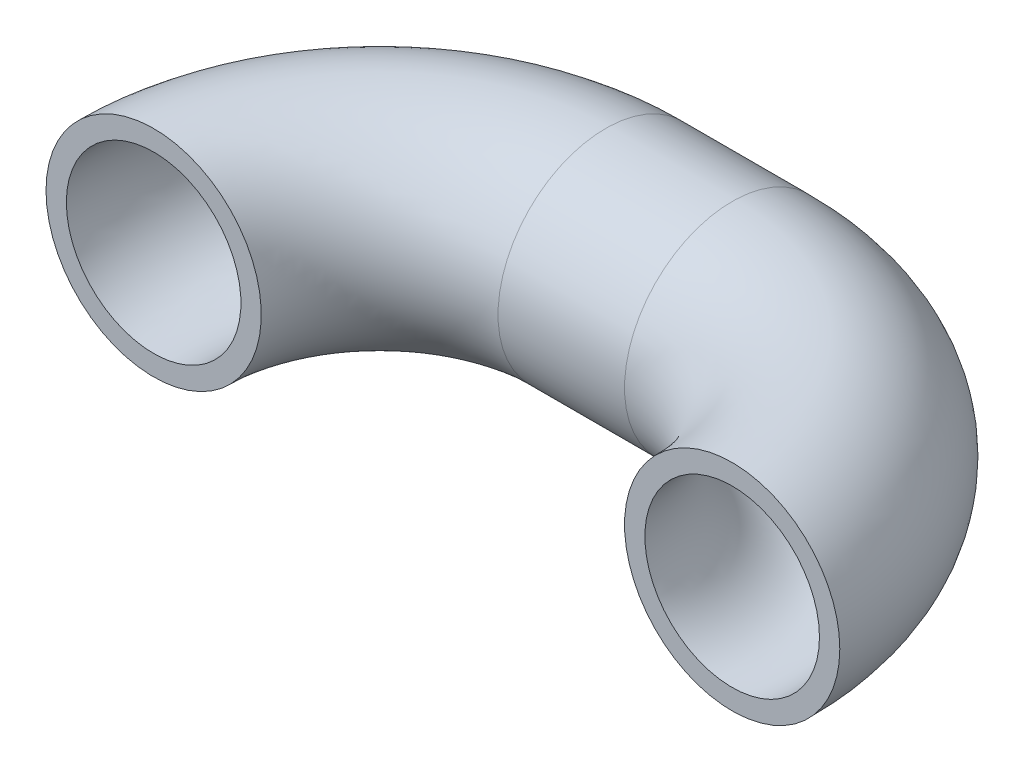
ISO-10303-21;
HEADER;
FILE_DESCRIPTION(('STEP AP214'),'2;1');
FILE_NAME('part.step','',(''),(''),'','','');
FILE_SCHEMA(('AUTOMOTIVE_DESIGN { 1 0 10303 214 1 1 1 1 }'));
ENDSEC;
DATA;
#1=APPLICATION_CONTEXT('core data for automotive mechanical design processes');
#2=APPLICATION_PROTOCOL_DEFINITION('international standard','automotive_design',2000,#1);
#3=PRODUCT_CONTEXT('',#1,'mechanical');
#4=PRODUCT('Part','Part','',(#3));
#5=PRODUCT_RELATED_PRODUCT_CATEGORY('part','',(#4));
#6=PRODUCT_DEFINITION_FORMATION('','',#4);
#7=PRODUCT_DEFINITION_CONTEXT('part definition',#1,'design');
#8=PRODUCT_DEFINITION('design','',#6,#7);
#9=PRODUCT_DEFINITION_SHAPE('','',#8);
#10=(LENGTH_UNIT() NAMED_UNIT(*) SI_UNIT(.MILLI.,.METRE.));
#11=(NAMED_UNIT(*) PLANE_ANGLE_UNIT() SI_UNIT($,.RADIAN.));
#12=(NAMED_UNIT(*) SI_UNIT($,.STERADIAN.) SOLID_ANGLE_UNIT());
#13=UNCERTAINTY_MEASURE_WITH_UNIT(LENGTH_MEASURE(1.E-05),#10,'distance_accuracy_value','');
#14=(GEOMETRIC_REPRESENTATION_CONTEXT(3) GLOBAL_UNCERTAINTY_ASSIGNED_CONTEXT((#13)) GLOBAL_UNIT_ASSIGNED_CONTEXT((#10,
#11,#12)) REPRESENTATION_CONTEXT('',''));
#15=CARTESIAN_POINT('',(0.,0.,0.));
#16=DIRECTION('',(0.,0.,1.));
#17=DIRECTION('',(1.,0.,0.));
#18=AXIS2_PLACEMENT_3D('',#15,#16,#17);
#19=CARTESIAN_POINT('',(-10.,0.,0.));
#20=DIRECTION('',(0.,-1.,0.));
#21=DIRECTION('',(0.,0.,-1.));
#22=AXIS2_PLACEMENT_3D('',#19,#20,#21);
#23=TOROIDAL_SURFACE('',#22,10.,3.8625);
#24=CARTESIAN_POINT('',(-10.,0.,-10.));
#25=DIRECTION('',(1.,0.,0.));
#26=DIRECTION('',(0.,0.,-1.));
#27=AXIS2_PLACEMENT_3D('',#24,#25,#26);
#28=CIRCLE('',#27,3.8625);
#29=CARTESIAN_POINT('',(-10.,0.,-13.8625));
#30=VERTEX_POINT('',#29);
#31=EDGE_CURVE('E10',#30,#30,#28,.T.);
#32=CARTESIAN_POINT('',(0.,0.,0.));
#33=DIRECTION('',(0.,0.,1.));
#34=DIRECTION('',(1.,0.,0.));
#35=AXIS2_PLACEMENT_3D('',#32,#33,#34);
#36=CIRCLE('',#35,3.8625);
#37=CARTESIAN_POINT('',(3.8625,0.,0.));
#38=VERTEX_POINT('',#37);
#39=EDGE_CURVE('E44',#38,#38,#36,.T.);
#40=CARTESIAN_POINT('',(-10.,0.,0.));
#41=DIRECTION('',(0.,-1.,0.));
#42=DIRECTION('',(0.,0.,-1.));
#43=AXIS2_PLACEMENT_3D('',#40,#41,#42);
#44=CIRCLE('',#43,13.8625);
#45=EDGE_CURVE('',#30,#38,#44,.T.);
#46=ORIENTED_EDGE('',*,*,#31,.F.);
#47=ORIENTED_EDGE('',*,*,#39,.T.);
#48=ORIENTED_EDGE('',*,*,#45,.T.);
#49=ORIENTED_EDGE('',*,*,#45,.F.);
#50=EDGE_LOOP('',(#46,#48,#47,#49));
#51=FACE_BOUND('',#50,.T.);
#52=ADVANCED_FACE('F33',(#51),#23,.F.);
#53=CARTESIAN_POINT('',(-10.,0.,0.));
#54=DIRECTION('',(0.,-1.,0.));
#55=DIRECTION('',(0.,0.,-1.));
#56=AXIS2_PLACEMENT_3D('',#53,#54,#55);
#57=TOROIDAL_SURFACE('',#56,10.,4.7625);
#58=CARTESIAN_POINT('',(-10.,0.,-10.));
#59=DIRECTION('',(-1.,0.,0.));
#60=DIRECTION('',(0.,0.,1.));
#61=AXIS2_PLACEMENT_3D('',#58,#59,#60);
#62=CIRCLE('',#61,4.7625);
#63=CARTESIAN_POINT('',(-10.0000000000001,0.,-14.7625));
#64=VERTEX_POINT('',#63);
#65=EDGE_CURVE('E51',#64,#64,#62,.T.);
#66=CARTESIAN_POINT('',(0.,0.,0.));
#67=DIRECTION('',(0.,0.,1.));
#68=DIRECTION('',(1.,0.,0.));
#69=AXIS2_PLACEMENT_3D('',#66,#67,#68);
#70=CIRCLE('',#69,4.7625);
#71=CARTESIAN_POINT('',(4.7625,0.,0.));
#72=VERTEX_POINT('',#71);
#73=EDGE_CURVE('E40',#72,#72,#70,.T.);
#74=CARTESIAN_POINT('',(-10.,0.,0.));
#75=DIRECTION('',(0.,-1.,0.));
#76=DIRECTION('',(0.,0.,-1.));
#77=AXIS2_PLACEMENT_3D('',#74,#75,#76);
#78=CIRCLE('',#77,14.7625);
#79=EDGE_CURVE('',#64,#72,#78,.T.);
#80=ORIENTED_EDGE('',*,*,#65,.F.);
#81=ORIENTED_EDGE('',*,*,#73,.F.);
#82=ORIENTED_EDGE('',*,*,#79,.T.);
#83=ORIENTED_EDGE('',*,*,#79,.F.);
#84=EDGE_LOOP('',(#80,#82,#81,#83));
#85=FACE_BOUND('',#84,.T.);
#86=ADVANCED_FACE('F35',(#85),#57,.T.);
#87=CARTESIAN_POINT('',(0.,0.,0.));
#88=DIRECTION('',(0.,0.,1.));
#89=DIRECTION('',(1.,0.,0.));
#90=AXIS2_PLACEMENT_3D('',#87,#88,#89);
#91=PLANE('',#90);
#92=ORIENTED_EDGE('',*,*,#39,.F.);
#93=EDGE_LOOP('',(#92));
#94=FACE_BOUND('',#93,.T.);
#95=ORIENTED_EDGE('',*,*,#73,.T.);
#96=EDGE_LOOP('',(#95));
#97=FACE_BOUND('',#96,.T.);
#98=ADVANCED_FACE('F90',(#94,#97),#91,.T.);
#99=CARTESIAN_POINT('',(-15.5976,0.,-9.99999999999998));
#100=DIRECTION('',(1.,0.,0.));
#101=DIRECTION('',(0.,0.,-1.));
#102=AXIS2_PLACEMENT_3D('',#99,#100,#101);
#103=CYLINDRICAL_SURFACE('',#102,4.7625);
#104=CARTESIAN_POINT('',(-15.5976,0.,-9.99999999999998));
#105=DIRECTION('',(-1.,0.,0.));
#106=DIRECTION('',(0.,0.,1.));
#107=AXIS2_PLACEMENT_3D('',#104,#105,#106);
#108=CIRCLE('',#107,4.7625);
#109=CARTESIAN_POINT('',(-15.5976,0.,-14.7625));
#110=VERTEX_POINT('',#109);
#111=EDGE_CURVE('E48',#110,#110,#108,.T.);
#112=ORIENTED_EDGE('',*,*,#111,.F.);
#113=EDGE_LOOP('',(#112));
#114=FACE_BOUND('',#113,.T.);
#115=ORIENTED_EDGE('',*,*,#65,.T.);
#116=EDGE_LOOP('',(#115));
#117=FACE_BOUND('',#116,.T.);
#118=ADVANCED_FACE('F96',(#114,#117),#103,.T.);
#119=CARTESIAN_POINT('',(-15.5976,0.,-9.99999999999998));
#120=DIRECTION('',(1.,0.,0.));
#121=DIRECTION('',(0.,0.,-1.));
#122=AXIS2_PLACEMENT_3D('',#119,#120,#121);
#123=CYLINDRICAL_SURFACE('',#122,3.8625);
#124=CARTESIAN_POINT('',(-15.5976,0.,-10.));
#125=DIRECTION('',(-1.,0.,0.));
#126=DIRECTION('',(0.,0.,1.));
#127=AXIS2_PLACEMENT_3D('',#124,#125,#126);
#128=CIRCLE('',#127,3.8625);
#129=CARTESIAN_POINT('',(-15.5976,0.,-13.8625));
#130=VERTEX_POINT('',#129);
#131=EDGE_CURVE('E54',#130,#130,#128,.T.);
#132=ORIENTED_EDGE('',*,*,#131,.T.);
#133=EDGE_LOOP('',(#132));
#134=FACE_BOUND('',#133,.T.);
#135=ORIENTED_EDGE('',*,*,#31,.T.);
#136=EDGE_LOOP('',(#135));
#137=FACE_BOUND('',#136,.T.);
#138=ADVANCED_FACE('F81',(#134,#137),#123,.F.);
#139=CARTESIAN_POINT('',(-15.5976,0.,0.));
#140=DIRECTION('',(0.,1.,0.));
#141=DIRECTION('',(0.,0.,1.));
#142=AXIS2_PLACEMENT_3D('',#139,#140,#141);
#143=TOROIDAL_SURFACE('',#142,10.,3.8625);
#144=CARTESIAN_POINT('',(-25.5976,0.,0.));
#145=DIRECTION('',(0.,0.,1.));
#146=DIRECTION('',(1.,0.,0.));
#147=AXIS2_PLACEMENT_3D('',#144,#145,#146);
#148=CIRCLE('',#147,3.8625);
#149=CARTESIAN_POINT('',(-29.4601,0.,0.));
#150=VERTEX_POINT('',#149);
#151=EDGE_CURVE('E62',#150,#150,#148,.T.);
#152=CARTESIAN_POINT('',(-15.5976,0.,0.));
#153=DIRECTION('',(0.,1.,0.));
#154=DIRECTION('',(0.,0.,1.));
#155=AXIS2_PLACEMENT_3D('',#152,#153,#154);
#156=CIRCLE('',#155,13.8625);
#157=EDGE_CURVE('',#130,#150,#156,.T.);
#158=ORIENTED_EDGE('',*,*,#131,.F.);
#159=ORIENTED_EDGE('',*,*,#151,.T.);
#160=ORIENTED_EDGE('',*,*,#157,.T.);
#161=ORIENTED_EDGE('',*,*,#157,.F.);
#162=EDGE_LOOP('',(#158,#160,#159,#161));
#163=FACE_BOUND('',#162,.T.);
#164=ADVANCED_FACE('F66',(#163),#143,.F.);
#165=CARTESIAN_POINT('',(-15.5976,0.,0.));
#166=DIRECTION('',(0.,1.,0.));
#167=DIRECTION('',(0.,0.,1.));
#168=AXIS2_PLACEMENT_3D('',#165,#166,#167);
#169=TOROIDAL_SURFACE('',#168,10.,4.7625);
#170=CARTESIAN_POINT('',(-25.5976,0.,0.));
#171=DIRECTION('',(0.,0.,1.));
#172=DIRECTION('',(1.,0.,0.));
#173=AXIS2_PLACEMENT_3D('',#170,#171,#172);
#174=CIRCLE('',#173,4.7625);
#175=CARTESIAN_POINT('',(-30.3601,0.,0.));
#176=VERTEX_POINT('',#175);
#177=EDGE_CURVE('E59',#176,#176,#174,.T.);
#178=CARTESIAN_POINT('',(-15.5976,0.,0.));
#179=DIRECTION('',(0.,1.,0.));
#180=DIRECTION('',(0.,0.,1.));
#181=AXIS2_PLACEMENT_3D('',#178,#179,#180);
#182=CIRCLE('',#181,14.7625);
#183=EDGE_CURVE('',#110,#176,#182,.T.);
#184=ORIENTED_EDGE('',*,*,#111,.T.);
#185=ORIENTED_EDGE('',*,*,#177,.F.);
#186=ORIENTED_EDGE('',*,*,#183,.T.);
#187=ORIENTED_EDGE('',*,*,#183,.F.);
#188=EDGE_LOOP('',(#184,#186,#185,#187));
#189=FACE_BOUND('',#188,.T.);
#190=ADVANCED_FACE('F71',(#189),#169,.T.);
#191=CARTESIAN_POINT('',(-25.5976,0.,0.));
#192=DIRECTION('',(0.,0.,1.));
#193=DIRECTION('',(1.,0.,0.));
#194=AXIS2_PLACEMENT_3D('',#191,#192,#193);
#195=PLANE('',#194);
#196=ORIENTED_EDGE('',*,*,#151,.F.);
#197=EDGE_LOOP('',(#196));
#198=FACE_BOUND('',#197,.T.);
#199=ORIENTED_EDGE('',*,*,#177,.T.);
#200=EDGE_LOOP('',(#199));
#201=FACE_BOUND('',#200,.T.);
#202=ADVANCED_FACE('F68',(#198,#201),#195,.T.);
#203=CLOSED_SHELL('',(#52,#86,#98,#118,#138,#164,#190,#202));
#204=MANIFOLD_SOLID_BREP('B2',#203);
#205=ADVANCED_BREP_SHAPE_REPRESENTATION('',(#18,#204),#14);
#206=SHAPE_DEFINITION_REPRESENTATION(#9,#205);
ENDSEC;
END-ISO-10303-21;
